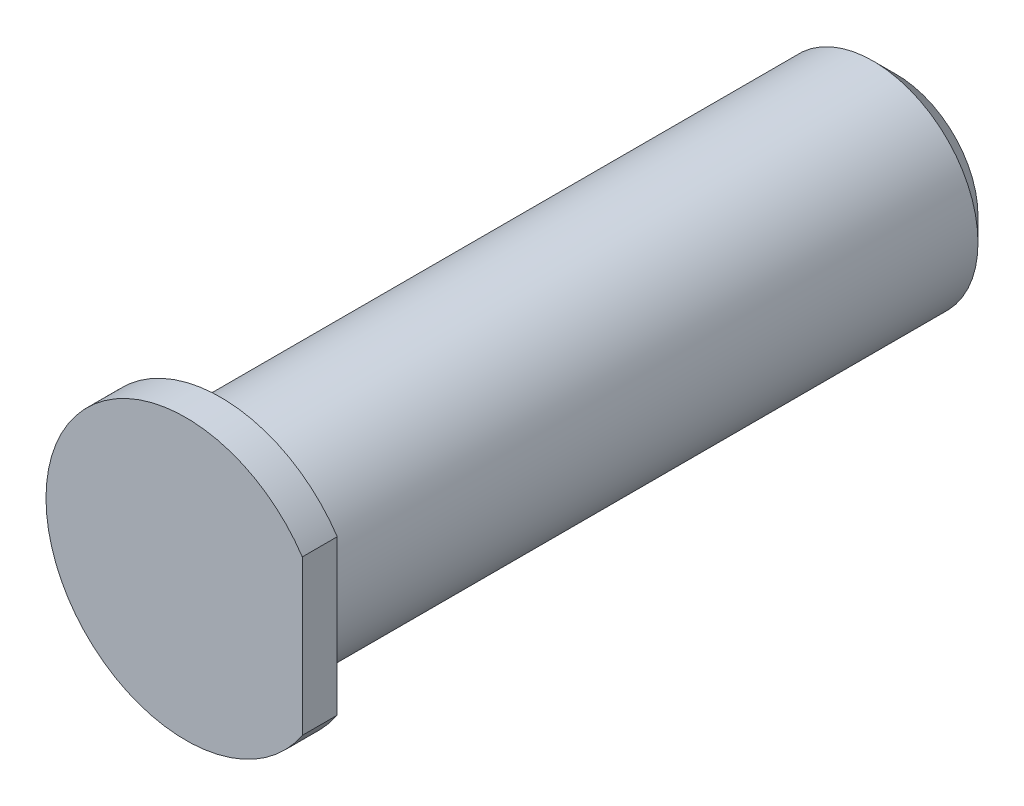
ISO-10303-21;
HEADER;
FILE_DESCRIPTION(('STEP AP214'),'2;1');
FILE_NAME('part.step','',(''),(''),'','','');
FILE_SCHEMA(('AUTOMOTIVE_DESIGN { 1 0 10303 214 1 1 1 1 }'));
ENDSEC;
DATA;
#1=APPLICATION_CONTEXT('core data for automotive mechanical design processes');
#2=APPLICATION_PROTOCOL_DEFINITION('international standard','automotive_design',2000,#1);
#3=PRODUCT_CONTEXT('',#1,'mechanical');
#4=PRODUCT('Part','Part','',(#3));
#5=PRODUCT_RELATED_PRODUCT_CATEGORY('part','',(#4));
#6=PRODUCT_DEFINITION_FORMATION('','',#4);
#7=PRODUCT_DEFINITION_CONTEXT('part definition',#1,'design');
#8=PRODUCT_DEFINITION('design','',#6,#7);
#9=PRODUCT_DEFINITION_SHAPE('','',#8);
#10=(LENGTH_UNIT() NAMED_UNIT(*) SI_UNIT(.MILLI.,.METRE.));
#11=(NAMED_UNIT(*) PLANE_ANGLE_UNIT() SI_UNIT($,.RADIAN.));
#12=(NAMED_UNIT(*) SI_UNIT($,.STERADIAN.) SOLID_ANGLE_UNIT());
#13=UNCERTAINTY_MEASURE_WITH_UNIT(LENGTH_MEASURE(1.E-05),#10,'distance_accuracy_value','');
#14=(GEOMETRIC_REPRESENTATION_CONTEXT(3) GLOBAL_UNCERTAINTY_ASSIGNED_CONTEXT((#13)) GLOBAL_UNIT_ASSIGNED_CONTEXT((#10,
#11,#12)) REPRESENTATION_CONTEXT('',''));
#15=CARTESIAN_POINT('',(0.,0.,0.));
#16=DIRECTION('',(0.,0.,1.));
#17=DIRECTION('',(1.,0.,0.));
#18=AXIS2_PLACEMENT_3D('',#15,#16,#17);
#19=CARTESIAN_POINT('',(0.,0.,-29.));
#20=DIRECTION('',(0.,0.,1.));
#21=DIRECTION('',(1.,0.,0.));
#22=AXIS2_PLACEMENT_3D('',#19,#20,#21);
#23=CYLINDRICAL_SURFACE('',#22,4.5);
#24=CARTESIAN_POINT('',(0.,0.,-28.));
#25=DIRECTION('',(0.,0.,1.));
#26=DIRECTION('',(1.,0.,0.));
#27=AXIS2_PLACEMENT_3D('',#24,#25,#26);
#28=CIRCLE('',#27,4.5);
#29=CARTESIAN_POINT('',(4.5,0.,-28.));
#30=VERTEX_POINT('',#29);
#31=EDGE_CURVE('E43',#30,#30,#28,.T.);
#32=CARTESIAN_POINT('',(0.,0.,0.));
#33=DIRECTION('',(0.,0.,1.));
#34=DIRECTION('',(1.,0.,0.));
#35=AXIS2_PLACEMENT_3D('',#32,#33,#34);
#36=CIRCLE('',#35,4.5);
#37=CARTESIAN_POINT('',(4.5,0.,0.));
#38=VERTEX_POINT('',#37);
#39=EDGE_CURVE('E80',#38,#38,#36,.T.);
#40=CARTESIAN_POINT('',(4.5,0.,-28.));
#41=CARTESIAN_POINT('',(4.5,0.,-27.7083333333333));
#42=CARTESIAN_POINT('',(4.5,0.,-27.4166666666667));
#43=CARTESIAN_POINT('',(4.5,0.,-26.8333333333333));
#44=CARTESIAN_POINT('',(4.5,0.,-26.5416666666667));
#45=CARTESIAN_POINT('',(4.5,0.,-25.9583333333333));
#46=CARTESIAN_POINT('',(4.5,0.,-25.6666666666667));
#47=CARTESIAN_POINT('',(4.5,0.,-25.0833333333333));
#48=CARTESIAN_POINT('',(4.5,0.,-24.7916666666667));
#49=CARTESIAN_POINT('',(4.5,0.,-24.2083333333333));
#50=CARTESIAN_POINT('',(4.5,0.,-23.9166666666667));
#51=CARTESIAN_POINT('',(4.5,0.,-23.3333333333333));
#52=CARTESIAN_POINT('',(4.5,0.,-23.0416666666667));
#53=CARTESIAN_POINT('',(4.5,0.,-22.4583333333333));
#54=CARTESIAN_POINT('',(4.5,0.,-22.1666666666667));
#55=CARTESIAN_POINT('',(4.5,0.,-21.5833333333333));
#56=CARTESIAN_POINT('',(4.5,0.,-21.2916666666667));
#57=CARTESIAN_POINT('',(4.5,0.,-20.7083333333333));
#58=CARTESIAN_POINT('',(4.5,0.,-20.4166666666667));
#59=CARTESIAN_POINT('',(4.5,0.,-19.8333333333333));
#60=CARTESIAN_POINT('',(4.5,0.,-19.5416666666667));
#61=CARTESIAN_POINT('',(4.5,0.,-18.9583333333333));
#62=CARTESIAN_POINT('',(4.5,0.,-18.6666666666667));
#63=CARTESIAN_POINT('',(4.5,0.,-18.0833333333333));
#64=CARTESIAN_POINT('',(4.5,0.,-17.7916666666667));
#65=CARTESIAN_POINT('',(4.5,0.,-17.2083333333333));
#66=CARTESIAN_POINT('',(4.5,0.,-16.9166666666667));
#67=CARTESIAN_POINT('',(4.5,0.,-16.3333333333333));
#68=CARTESIAN_POINT('',(4.5,0.,-16.0416666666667));
#69=CARTESIAN_POINT('',(4.5,0.,-15.4583333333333));
#70=CARTESIAN_POINT('',(4.5,0.,-15.1666666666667));
#71=CARTESIAN_POINT('',(4.5,0.,-14.5833333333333));
#72=CARTESIAN_POINT('',(4.5,0.,-14.2916666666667));
#73=CARTESIAN_POINT('',(4.5,0.,-13.7083333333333));
#74=CARTESIAN_POINT('',(4.5,0.,-13.4166666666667));
#75=CARTESIAN_POINT('',(4.5,0.,-12.8333333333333));
#76=CARTESIAN_POINT('',(4.5,0.,-12.5416666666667));
#77=CARTESIAN_POINT('',(4.5,0.,-11.9583333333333));
#78=CARTESIAN_POINT('',(4.5,0.,-11.6666666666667));
#79=CARTESIAN_POINT('',(4.5,0.,-11.0833333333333));
#80=CARTESIAN_POINT('',(4.5,0.,-10.7916666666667));
#81=CARTESIAN_POINT('',(4.5,0.,-10.2083333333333));
#82=CARTESIAN_POINT('',(4.5,0.,-9.91666666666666));
#83=CARTESIAN_POINT('',(4.5,0.,-9.33333333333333));
#84=CARTESIAN_POINT('',(4.5,0.,-9.04166666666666));
#85=CARTESIAN_POINT('',(4.5,0.,-8.45833333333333));
#86=CARTESIAN_POINT('',(4.5,0.,-8.16666666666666));
#87=CARTESIAN_POINT('',(4.5,0.,-7.58333333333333));
#88=CARTESIAN_POINT('',(4.5,0.,-7.29166666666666));
#89=CARTESIAN_POINT('',(4.5,0.,-6.70833333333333));
#90=CARTESIAN_POINT('',(4.5,0.,-6.41666666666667));
#91=CARTESIAN_POINT('',(4.5,0.,-5.83333333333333));
#92=CARTESIAN_POINT('',(4.5,0.,-5.54166666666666));
#93=CARTESIAN_POINT('',(4.5,0.,-4.95833333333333));
#94=CARTESIAN_POINT('',(4.5,0.,-4.66666666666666));
#95=CARTESIAN_POINT('',(4.5,0.,-4.08333333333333));
#96=CARTESIAN_POINT('',(4.5,0.,-3.79166666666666));
#97=CARTESIAN_POINT('',(4.5,0.,-3.20833333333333));
#98=CARTESIAN_POINT('',(4.5,0.,-2.91666666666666));
#99=CARTESIAN_POINT('',(4.5,0.,-2.33333333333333));
#100=CARTESIAN_POINT('',(4.5,0.,-2.04166666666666));
#101=CARTESIAN_POINT('',(4.5,0.,-1.45833333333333));
#102=CARTESIAN_POINT('',(4.5,0.,-1.16666666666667));
#103=CARTESIAN_POINT('',(4.5,0.,-0.583333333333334));
#104=CARTESIAN_POINT('',(4.5,0.,-0.291666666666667));
#105=CARTESIAN_POINT('',(4.5,0.,0.));
#106=B_SPLINE_CURVE_WITH_KNOTS('',3,(#40,#41,#42,#43,#44,#45,#46,#47,#48,#49,#50,#51,#52,#53,
#54,#55,#56,#57,#58,#59,#60,#61,#62,#63,#64,#65,#66,#67,#68,#69,#70,#71,#72,#73,#74,#75,#76,#77,
#78,#79,#80,#81,#82,#83,#84,#85,#86,#87,#88,#89,#90,#91,#92,#93,#94,#95,#96,#97,#98,#99,#100,
#101,#102,#103,#104,#105),.UNSPECIFIED.,.F.,.F.,(4,2,2,2,2,2,2,2,2,2,2,2,2,2,2,2,2,2,2,2,2,2,2,
2,2,2,2,2,2,2,2,2,4),(0.,0.875000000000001,1.75,2.625,3.5,4.375,5.25,6.125,7.,7.875,8.75,9.625,
10.5,11.375,12.25,13.125,14.,14.875,15.75,16.625,17.5,18.375,19.25,20.125,21.,21.875,22.75,
23.625,24.5,25.375,26.25,27.125,28.),.UNSPECIFIED.);
#107=EDGE_CURVE('BSEAM34',#30,#38,#106,.T.);
#108=ORIENTED_EDGE('',*,*,#31,.T.);
#109=ORIENTED_EDGE('',*,*,#39,.F.);
#110=ORIENTED_EDGE('',*,*,#107,.T.);
#111=ORIENTED_EDGE('',*,*,#107,.F.);
#112=EDGE_LOOP('',(#108,#110,#109,#111));
#113=FACE_BOUND('',#112,.T.);
#114=ADVANCED_FACE('F34',(#113),#23,.T.);
#115=CARTESIAN_POINT('',(0.,0.,-29.));
#116=DIRECTION('',(0.,0.,1.));
#117=DIRECTION('',(1.,0.,0.));
#118=AXIS2_PLACEMENT_3D('',#115,#116,#117);
#119=PLANE('',#118);
#120=CARTESIAN_POINT('',(0.,0.,-29.));
#121=DIRECTION('',(0.,0.,1.));
#122=DIRECTION('',(1.,0.,0.));
#123=AXIS2_PLACEMENT_3D('',#120,#121,#122);
#124=CIRCLE('',#123,3.49999999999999);
#125=CARTESIAN_POINT('',(3.49999999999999,0.,-29.));
#126=VERTEX_POINT('',#125);
#127=EDGE_CURVE('E11',#126,#126,#124,.F.);
#128=ORIENTED_EDGE('',*,*,#127,.T.);
#129=EDGE_LOOP('',(#128));
#130=FACE_BOUND('',#129,.T.);
#131=CARTESIAN_POINT('',(0.,0.,-29.));
#132=DIRECTION('',(0.,0.,-1.));
#133=DIRECTION('',(-1.,0.,0.));
#134=AXIS2_PLACEMENT_3D('',#131,#132,#133);
#135=CIRCLE('',#134,2.);
#136=CARTESIAN_POINT('',(-2.,0.,-29.));
#137=VERTEX_POINT('',#136);
#138=EDGE_CURVE('E125',#137,#137,#135,.T.);
#139=ORIENTED_EDGE('',*,*,#138,.F.);
#140=EDGE_LOOP('',(#139));
#141=FACE_BOUND('',#140,.T.);
#142=ADVANCED_FACE('F98',(#130,#141),#119,.F.);
#143=CARTESIAN_POINT('',(0.,0.,1.5));
#144=DIRECTION('',(0.,0.,-1.));
#145=DIRECTION('',(-1.,0.,0.));
#146=AXIS2_PLACEMENT_3D('',#143,#144,#145);
#147=CYLINDRICAL_SURFACE('',#146,6.);
#148=CARTESIAN_POINT('',(0.,0.,0.));
#149=DIRECTION('',(0.,0.,1.));
#150=DIRECTION('',(1.,0.,0.));
#151=AXIS2_PLACEMENT_3D('',#148,#149,#150);
#152=CIRCLE('',#151,6.);
#153=CARTESIAN_POINT('',(5.,3.3166247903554,0.));
#154=VERTEX_POINT('',#153);
#155=CARTESIAN_POINT('',(5.,-3.3166247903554,0.));
#156=VERTEX_POINT('',#155);
#157=EDGE_CURVE('E63',#154,#156,#152,.T.);
#158=ORIENTED_EDGE('',*,*,#157,.T.);
#159=DIRECTION('',(0.,0.,-1.));
#160=VECTOR('',#159,1.);
#161=CARTESIAN_POINT('',(5.,-3.3166247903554,1.5));
#162=LINE('',#161,#160);
#163=CARTESIAN_POINT('',(5.,-3.3166247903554,1.5));
#164=VERTEX_POINT('',#163);
#165=EDGE_CURVE('E58',#164,#156,#162,.T.);
#166=ORIENTED_EDGE('',*,*,#165,.F.);
#167=CARTESIAN_POINT('',(0.,0.,1.5));
#168=DIRECTION('',(0.,0.,1.));
#169=DIRECTION('',(1.,0.,0.));
#170=AXIS2_PLACEMENT_3D('',#167,#168,#169);
#171=CIRCLE('',#170,6.);
#172=CARTESIAN_POINT('',(5.,3.3166247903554,1.5));
#173=VERTEX_POINT('',#172);
#174=EDGE_CURVE('E65',#173,#164,#171,.T.);
#175=ORIENTED_EDGE('',*,*,#174,.F.);
#176=DIRECTION('',(0.,0.,-1.));
#177=VECTOR('',#176,1.);
#178=CARTESIAN_POINT('',(5.,3.3166247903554,1.5));
#179=LINE('',#178,#177);
#180=EDGE_CURVE('E51',#173,#154,#179,.T.);
#181=ORIENTED_EDGE('',*,*,#180,.T.);
#182=EDGE_LOOP('',(#158,#166,#175,#181));
#183=FACE_BOUND('',#182,.T.);
#184=ADVANCED_FACE('F62',(#183),#147,.T.);
#185=CARTESIAN_POINT('',(5.,3.3166247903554,1.5));
#186=DIRECTION('',(1.,0.,0.));
#187=DIRECTION('',(0.,0.,-1.));
#188=AXIS2_PLACEMENT_3D('',#185,#186,#187);
#189=PLANE('',#188);
#190=DIRECTION('',(0.,-1.,0.));
#191=VECTOR('',#190,1.);
#192=CARTESIAN_POINT('',(5.,3.3166247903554,0.));
#193=LINE('',#192,#191);
#194=EDGE_CURVE('E71',#154,#156,#193,.T.);
#195=ORIENTED_EDGE('',*,*,#194,.F.);
#196=ORIENTED_EDGE('',*,*,#180,.F.);
#197=DIRECTION('',(0.,-1.,0.));
#198=VECTOR('',#197,1.);
#199=CARTESIAN_POINT('',(5.,3.3166247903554,1.5));
#200=LINE('',#199,#198);
#201=EDGE_CURVE('E67',#173,#164,#200,.T.);
#202=ORIENTED_EDGE('',*,*,#201,.T.);
#203=ORIENTED_EDGE('',*,*,#165,.T.);
#204=EDGE_LOOP('',(#195,#196,#202,#203));
#205=FACE_BOUND('',#204,.T.);
#206=ADVANCED_FACE('F74',(#205),#189,.T.);
#207=CARTESIAN_POINT('',(0.,0.,1.5));
#208=DIRECTION('',(0.,0.,1.));
#209=DIRECTION('',(1.,0.,0.));
#210=AXIS2_PLACEMENT_3D('',#207,#208,#209);
#211=PLANE('',#210);
#212=ORIENTED_EDGE('',*,*,#174,.T.);
#213=ORIENTED_EDGE('',*,*,#201,.F.);
#214=EDGE_LOOP('',(#212,#213));
#215=FACE_BOUND('',#214,.T.);
#216=ADVANCED_FACE('F109',(#215),#211,.T.);
#217=CARTESIAN_POINT('',(0.,0.,0.));
#218=DIRECTION('',(0.,0.,1.));
#219=DIRECTION('',(1.,0.,0.));
#220=AXIS2_PLACEMENT_3D('',#217,#218,#219);
#221=PLANE('',#220);
#222=ORIENTED_EDGE('',*,*,#39,.T.);
#223=EDGE_LOOP('',(#222));
#224=FACE_BOUND('',#223,.T.);
#225=ORIENTED_EDGE('',*,*,#157,.F.);
#226=ORIENTED_EDGE('',*,*,#194,.T.);
#227=EDGE_LOOP('',(#225,#226));
#228=FACE_BOUND('',#227,.T.);
#229=ADVANCED_FACE('F70',(#224,#228),#221,.F.);
#230=CARTESIAN_POINT('',(0.,0.,-25.5));
#231=DIRECTION('',(0.,0.,-1.));
#232=DIRECTION('',(-1.,0.,0.));
#233=AXIS2_PLACEMENT_3D('',#230,#231,#232);
#234=CYLINDRICAL_SURFACE('',#233,2.);
#235=CARTESIAN_POINT('',(0.,0.,-25.5));
#236=DIRECTION('',(0.,0.,-1.));
#237=DIRECTION('',(-1.,0.,0.));
#238=AXIS2_PLACEMENT_3D('',#235,#236,#237);
#239=CIRCLE('',#238,2.);
#240=CARTESIAN_POINT('',(-2.,0.,-25.5));
#241=VERTEX_POINT('',#240);
#242=EDGE_CURVE('E72',#241,#241,#239,.T.);
#243=ORIENTED_EDGE('',*,*,#242,.F.);
#244=EDGE_LOOP('',(#243));
#245=FACE_BOUND('',#244,.T.);
#246=ORIENTED_EDGE('',*,*,#138,.T.);
#247=EDGE_LOOP('',(#246));
#248=FACE_BOUND('',#247,.T.);
#249=ADVANCED_FACE('F93',(#245,#248),#234,.F.);
#250=CARTESIAN_POINT('',(0.,0.,-25.5));
#251=DIRECTION('',(0.,0.,-1.));
#252=DIRECTION('',(-1.,0.,0.));
#253=AXIS2_PLACEMENT_3D('',#250,#251,#252);
#254=PLANE('',#253);
#255=ORIENTED_EDGE('',*,*,#242,.T.);
#256=EDGE_LOOP('',(#255));
#257=FACE_BOUND('',#256,.T.);
#258=ADVANCED_FACE('F88',(#257),#254,.T.);
#259=CARTESIAN_POINT('',(0.,0.,-28.));
#260=DIRECTION('',(0.,0.,1.));
#261=DIRECTION('',(1.,0.,0.));
#262=AXIS2_PLACEMENT_3D('',#259,#260,#261);
#263=CONICAL_SURFACE('',#262,4.5,0.785398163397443);
#264=ORIENTED_EDGE('',*,*,#127,.F.);
#265=EDGE_LOOP('',(#264));
#266=FACE_BOUND('',#265,.T.);
#267=ORIENTED_EDGE('',*,*,#31,.F.);
#268=EDGE_LOOP('',(#267));
#269=FACE_BOUND('',#268,.T.);
#270=ADVANCED_FACE('F36',(#266,#269),#263,.T.);
#271=CLOSED_SHELL('',(#114,#142,#184,#206,#216,#229,#249,#258,#270));
#272=MANIFOLD_SOLID_BREP('B2',#271);
#273=ADVANCED_BREP_SHAPE_REPRESENTATION('',(#18,#272),#14);
#274=SHAPE_DEFINITION_REPRESENTATION(#9,#273);
ENDSEC;
END-ISO-10303-21;
